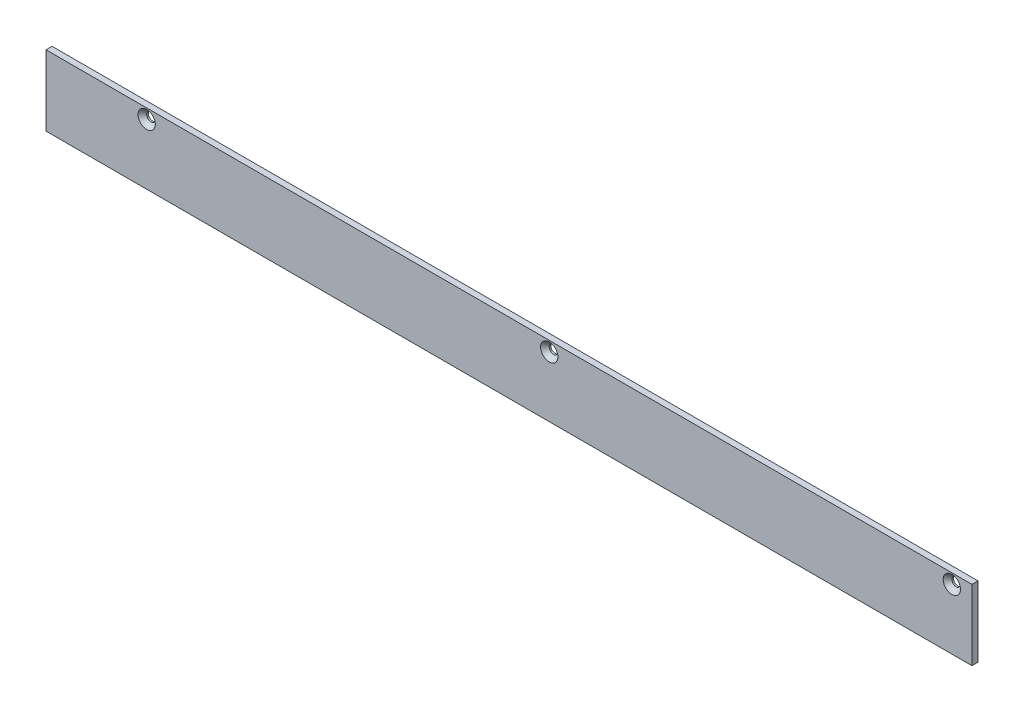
from build123d import *

# Parameters (mm, degrees)
SKETCH_2_W          = 460
SKETCH_2_H          = 35
EXTRUDE_1_DEPTH     = 3
SKETCH_3_R          = 4.3
CUT_EXTRUDE_1_DEPTH = 2.15
DRAFT_1_ANGLE       = 45
SKETCH_4_R          = 2.15
CUT_EXTRUDE_2_DEPTH = 462.334610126
SKETCH_5_R          = 2.15
CUT_EXTRUDE_3_DEPTH = 462.334610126
SKETCH_6_R          = 2.15
CUT_EXTRUDE_4_DEPTH = 462.334610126


with BuildPart() as part:
    # Sketch 2 → Extrude 1 (new body)
    with BuildSketch(Plane.XY):
        with Locations((230, 17.5)):
            Rectangle(SKETCH_2_W, SKETCH_2_H)
    extrude(amount=EXTRUDE_1_DEPTH)

    # Sketch 3 → Cut-Extrude 1 (cut)
    with BuildSketch(Plane.XY.offset(3)):
        with Locations((50, 30)):
            Circle(SKETCH_3_R)
        with Locations((250, 30)):
            Circle(SKETCH_3_R)
        with Locations((450, 30)):
            Circle(SKETCH_3_R)
    extrude(amount=-CUT_EXTRUDE_1_DEPTH, mode=Mode.SUBTRACT)

    # Draft 1
    draft_1_faces = [part.faces().sort_by_distance(p)[0] for p in [
        (445.7, 30, 1.925),
        (245.7, 30, 1.925),
        (45.7, 30, 1.925),
    ]]
    draft(draft_1_faces, Plane.XY.offset(3), DRAFT_1_ANGLE)

    # Sketch 4 → Cut-Extrude 2 (cut, through all)
    with BuildSketch(Plane.XY.offset(0.85)):
        with Locations((50, 30)):
            Circle(SKETCH_4_R)
    extrude(amount=-CUT_EXTRUDE_2_DEPTH, mode=Mode.SUBTRACT)

    # Sketch 5 → Cut-Extrude 3 (cut, through all)
    with BuildSketch(Plane.XY.offset(0.85)):
        with Locations((250, 30)):
            Circle(SKETCH_5_R)
    extrude(amount=-CUT_EXTRUDE_3_DEPTH, mode=Mode.SUBTRACT)

    # Sketch 6 → Cut-Extrude 4 (cut, through all)
    with BuildSketch(Plane.XY.offset(0.85)):
        with Locations((450, 30)):
            Circle(SKETCH_6_R)
    extrude(amount=-CUT_EXTRUDE_4_DEPTH, mode=Mode.SUBTRACT)


solid = part.part
